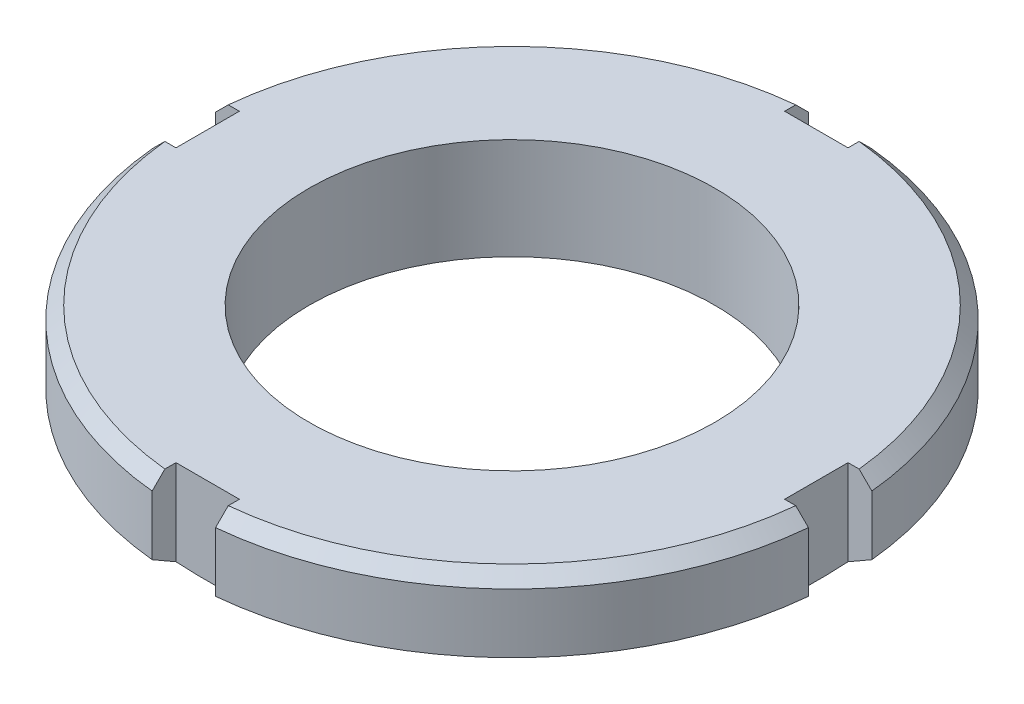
ISO-10303-21;
HEADER;
FILE_DESCRIPTION(('STEP AP214'),'2;1');
FILE_NAME('part.step','',(''),(''),'','','');
FILE_SCHEMA(('AUTOMOTIVE_DESIGN { 1 0 10303 214 1 1 1 1 }'));
ENDSEC;
DATA;
#1=APPLICATION_CONTEXT('core data for automotive mechanical design processes');
#2=APPLICATION_PROTOCOL_DEFINITION('international standard','automotive_design',2000,#1);
#3=PRODUCT_CONTEXT('',#1,'mechanical');
#4=PRODUCT('Part','Part','',(#3));
#5=PRODUCT_RELATED_PRODUCT_CATEGORY('part','',(#4));
#6=PRODUCT_DEFINITION_FORMATION('','',#4);
#7=PRODUCT_DEFINITION_CONTEXT('part definition',#1,'design');
#8=PRODUCT_DEFINITION('design','',#6,#7);
#9=PRODUCT_DEFINITION_SHAPE('','',#8);
#10=(LENGTH_UNIT() NAMED_UNIT(*) SI_UNIT(.MILLI.,.METRE.));
#11=(NAMED_UNIT(*) PLANE_ANGLE_UNIT() SI_UNIT($,.RADIAN.));
#12=(NAMED_UNIT(*) SI_UNIT($,.STERADIAN.) SOLID_ANGLE_UNIT());
#13=UNCERTAINTY_MEASURE_WITH_UNIT(LENGTH_MEASURE(1.E-05),#10,'distance_accuracy_value','');
#14=(GEOMETRIC_REPRESENTATION_CONTEXT(3) GLOBAL_UNCERTAINTY_ASSIGNED_CONTEXT((#13)) GLOBAL_UNIT_ASSIGNED_CONTEXT((#10,
#11,#12)) REPRESENTATION_CONTEXT('',''));
#15=CARTESIAN_POINT('',(0.,0.,0.));
#16=DIRECTION('',(0.,0.,1.));
#17=DIRECTION('',(1.,0.,0.));
#18=AXIS2_PLACEMENT_3D('',#15,#16,#17);
#19=CARTESIAN_POINT('',(0.,38.0188235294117,0.));
#20=DIRECTION('',(0.,1.,0.));
#21=DIRECTION('',(-1.00000000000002,0.,0.));
#22=AXIS2_PLACEMENT_3D('',#19,#20,#21);
#23=CYLINDRICAL_SURFACE('',#22,26.);
#24=CARTESIAN_POINT('',(0.,-1.,0.));
#25=DIRECTION('',(0.,-1.,0.));
#26=DIRECTION('',(1.00000000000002,0.,0.));
#27=AXIS2_PLACEMENT_3D('',#24,#25,#26);
#28=CIRCLE('',#27,26.);
#29=CARTESIAN_POINT('',(-2.50000000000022,-1.,25.8795285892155));
#30=VERTEX_POINT('',#29);
#31=CARTESIAN_POINT('',(-25.8795285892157,-1.,2.49999999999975));
#32=VERTEX_POINT('',#31);
#33=EDGE_CURVE('E367',#30,#32,#28,.T.);
#34=ORIENTED_EDGE('',*,*,#33,.T.);
#35=DIRECTION('',(0.,1.,0.));
#36=VECTOR('',#35,1.);
#37=CARTESIAN_POINT('',(-25.8795285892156,38.0188235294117,2.49999999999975));
#38=LINE('',#37,#36);
#39=CARTESIAN_POINT('',(-25.8795285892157,-5.6905989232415,2.49999999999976));
#40=VERTEX_POINT('',#39);
#41=EDGE_CURVE('E193',#32,#40,#38,.F.);
#42=ORIENTED_EDGE('',*,*,#41,.T.);
#43=CARTESIAN_POINT('',(0.,-5.6905989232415,0.));
#44=DIRECTION('',(0.,1.,0.));
#45=DIRECTION('',(-1.00000000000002,0.,0.));
#46=AXIS2_PLACEMENT_3D('',#43,#44,#45);
#47=CIRCLE('',#46,26.);
#48=CARTESIAN_POINT('',(-2.50000000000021,-5.6905989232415,25.8795285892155));
#49=VERTEX_POINT('',#48);
#50=EDGE_CURVE('E351',#40,#49,#47,.T.);
#51=ORIENTED_EDGE('',*,*,#50,.T.);
#52=DIRECTION('',(0.,1.,0.));
#53=VECTOR('',#52,1.);
#54=CARTESIAN_POINT('',(-2.50000000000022,38.0188235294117,25.8795285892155));
#55=LINE('',#54,#53);
#56=EDGE_CURVE('E379',#49,#30,#55,.T.);
#57=ORIENTED_EDGE('',*,*,#56,.T.);
#58=EDGE_LOOP('',(#34,#42,#51,#57));
#59=FACE_BOUND('',#58,.T.);
#60=ADVANCED_FACE('F16',(#59),#23,.T.);
#61=CARTESIAN_POINT('',(0.,0.,0.));
#62=DIRECTION('',(0.,-1.,0.));
#63=DIRECTION('',(1.00000000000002,0.,0.));
#64=AXIS2_PLACEMENT_3D('',#61,#62,#63);
#65=CONICAL_SURFACE('',#64,25.,0.785398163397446);
#66=CARTESIAN_POINT('',(-28.8361348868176,-3.94430298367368,2.49999999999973));
#67=CARTESIAN_POINT('',(-28.3118080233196,-3.4219371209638,2.49999999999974));
#68=CARTESIAN_POINT('',(-27.7874295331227,-2.8996230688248,2.49999999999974));
#69=CARTESIAN_POINT('',(-26.7385465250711,-1.85512161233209,2.49999999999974));
#70=CARTESIAN_POINT('',(-26.2140420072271,-1.33293420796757,2.49999999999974));
#71=CARTESIAN_POINT('',(-25.1648840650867,-0.288708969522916,2.49999999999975));
#72=CARTESIAN_POINT('',(-24.6402306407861,0.233328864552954,2.49999999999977));
#73=CARTESIAN_POINT('',(-23.5907418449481,1.27722169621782,2.49999999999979));
#74=CARTESIAN_POINT('',(-23.0659064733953,1.79907669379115,2.4999999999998));
#75=CARTESIAN_POINT('',(-22.5409636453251,2.32082360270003,2.4999999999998));
#76=B_SPLINE_CURVE_WITH_KNOTS('',3,(#66,#67,#68,#69,#70,#71,#72,#73,#74,#75),.UNSPECIFIED.,.F.,
.F.,(4,2,2,2,4),(0.,2.22037447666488,4.44074876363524,6.66112311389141,8.88149765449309),.UNSPECIFIED.);
#77=CARTESIAN_POINT('',(-24.8746859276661,0.,2.49999999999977));
#78=VERTEX_POINT('',#77);
#79=EDGE_CURVE('E11',#32,#78,#76,.T.);
#80=ORIENTED_EDGE('',*,*,#79,.F.);
#81=ORIENTED_EDGE('',*,*,#33,.F.);
#82=CARTESIAN_POINT('',(-2.50000000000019,3.0690672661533,21.7879739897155));
#83=CARTESIAN_POINT('',(-2.50000000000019,2.54743215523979,22.3130279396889));
#84=CARTESIAN_POINT('',(-2.50000000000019,2.02567763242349,22.8379632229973));
#85=CARTESIAN_POINT('',(-2.5000000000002,0.981967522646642,23.8876337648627));
#86=CARTESIAN_POINT('',(-2.5000000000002,0.460011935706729,24.4123690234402));
#87=CARTESIAN_POINT('',(-2.50000000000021,-0.584062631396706,25.4616769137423));
#88=CARTESIAN_POINT('',(-2.50000000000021,-1.10618161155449,25.9862495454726));
#89=CARTESIAN_POINT('',(-2.50000000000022,-2.15055730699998,27.0352577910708));
#90=CARTESIAN_POINT('',(-2.50000000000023,-2.67281402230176,27.5596934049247));
#91=CARTESIAN_POINT('',(-2.50000000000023,-3.19512671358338,28.0840732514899));
#92=B_SPLINE_CURVE_WITH_KNOTS('',3,(#82,#83,#84,#85,#86,#87,#88,#89,#90,#91),.UNSPECIFIED.,.F.,
.F.,(4,2,2,2,4),(0.,2.22037459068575,4.44074895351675,6.66112323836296,8.88149775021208),.UNSPECIFIED.);
#93=CARTESIAN_POINT('',(-2.50000000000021,0.,24.874685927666));
#94=VERTEX_POINT('',#93);
#95=EDGE_CURVE('E215',#94,#30,#92,.T.);
#96=ORIENTED_EDGE('',*,*,#95,.F.);
#97=CARTESIAN_POINT('',(0.,0.,0.));
#98=DIRECTION('',(0.,-1.,0.));
#99=DIRECTION('',(1.00000000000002,0.,0.));
#100=AXIS2_PLACEMENT_3D('',#97,#98,#99);
#101=CIRCLE('',#100,25.);
#102=EDGE_CURVE('E44',#78,#94,#101,.F.);
#103=ORIENTED_EDGE('',*,*,#102,.F.);
#104=EDGE_LOOP('',(#80,#81,#96,#103));
#105=FACE_BOUND('',#104,.T.);
#106=ADVANCED_FACE('F382',(#105),#65,.T.);
#107=CARTESIAN_POINT('',(25.8795285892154,-1.,2.50000000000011));
#108=VERTEX_POINT('',#107);
#109=CARTESIAN_POINT('',(2.49999999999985,-1.,25.8795285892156));
#110=VERTEX_POINT('',#109);
#111=EDGE_CURVE('E362',#108,#110,#28,.T.);
#112=ORIENTED_EDGE('',*,*,#111,.T.);
#113=DIRECTION('',(0.,1.,0.));
#114=VECTOR('',#113,1.);
#115=CARTESIAN_POINT('',(2.49999999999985,38.0188235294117,25.8795285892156));
#116=LINE('',#115,#114);
#117=CARTESIAN_POINT('',(2.49999999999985,-5.6905989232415,25.8795285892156));
#118=VERTEX_POINT('',#117);
#119=EDGE_CURVE('E243',#110,#118,#116,.F.);
#120=ORIENTED_EDGE('',*,*,#119,.T.);
#121=CARTESIAN_POINT('',(25.8795285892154,-5.6905989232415,2.50000000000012));
#122=VERTEX_POINT('',#121);
#123=EDGE_CURVE('E414',#118,#122,#47,.T.);
#124=ORIENTED_EDGE('',*,*,#123,.T.);
#125=DIRECTION('',(0.,1.,0.));
#126=VECTOR('',#125,1.);
#127=CARTESIAN_POINT('',(25.8795285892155,38.0188235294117,2.50000000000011));
#128=LINE('',#127,#126);
#129=EDGE_CURVE('E262',#122,#108,#128,.T.);
#130=ORIENTED_EDGE('',*,*,#129,.T.);
#131=EDGE_LOOP('',(#112,#120,#124,#130));
#132=FACE_BOUND('',#131,.T.);
#133=ADVANCED_FACE('F462',(#132),#23,.T.);
#134=CARTESIAN_POINT('',(2.49999999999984,-3.19512671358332,28.0840732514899));
#135=CARTESIAN_POINT('',(2.49999999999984,-2.67281402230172,27.5596934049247));
#136=CARTESIAN_POINT('',(2.49999999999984,-2.15055730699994,27.0352577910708));
#137=CARTESIAN_POINT('',(2.49999999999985,-1.10618161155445,25.9862495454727));
#138=CARTESIAN_POINT('',(2.49999999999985,-0.584062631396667,25.4616769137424));
#139=CARTESIAN_POINT('',(2.49999999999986,0.460011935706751,24.4123690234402));
#140=CARTESIAN_POINT('',(2.49999999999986,0.981967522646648,23.8876337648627));
#141=CARTESIAN_POINT('',(2.49999999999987,2.02567763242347,22.8379632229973));
#142=CARTESIAN_POINT('',(2.49999999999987,2.54743215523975,22.313027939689));
#143=CARTESIAN_POINT('',(2.49999999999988,3.06906726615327,21.7879739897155));
#144=B_SPLINE_CURVE_WITH_KNOTS('',3,(#134,#135,#136,#137,#138,#139,#140,#141,#142,#143),
.UNSPECIFIED.,.F.,.F.,(4,2,2,2,4),(0.,2.22037451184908,4.44074879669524,6.66112315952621,
8.88149775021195),.UNSPECIFIED.);
#145=CARTESIAN_POINT('',(2.49999999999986,0.,24.874685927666));
#146=VERTEX_POINT('',#145);
#147=EDGE_CURVE('E209',#110,#146,#144,.T.);
#148=ORIENTED_EDGE('',*,*,#147,.F.);
#149=ORIENTED_EDGE('',*,*,#111,.F.);
#150=CARTESIAN_POINT('',(21.7879739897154,3.0690672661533,2.50000000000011));
#151=CARTESIAN_POINT('',(22.3130279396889,2.54743215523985,2.50000000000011));
#152=CARTESIAN_POINT('',(22.8379632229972,2.02567763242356,2.50000000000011));
#153=CARTESIAN_POINT('',(23.8876337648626,0.981967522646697,2.50000000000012));
#154=CARTESIAN_POINT('',(24.4123690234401,0.460011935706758,2.50000000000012));
#155=CARTESIAN_POINT('',(25.4616769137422,-0.584062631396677,2.50000000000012));
#156=CARTESIAN_POINT('',(25.9862495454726,-1.10618161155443,2.50000000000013));
#157=CARTESIAN_POINT('',(27.0352577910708,-2.1505573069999,2.50000000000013));
#158=CARTESIAN_POINT('',(27.5596934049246,-2.67281402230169,2.50000000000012));
#159=CARTESIAN_POINT('',(28.0840732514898,-3.19512671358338,2.50000000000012));
#160=B_SPLINE_CURVE_WITH_KNOTS('',3,(#150,#151,#152,#153,#154,#155,#156,#157,#158,#159),
.UNSPECIFIED.,.F.,.F.,(4,2,2,2,4),(0.,2.22037459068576,4.44074895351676,6.66112323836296,
8.88149775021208),.UNSPECIFIED.);
#161=CARTESIAN_POINT('',(24.8746859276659,0.,2.50000000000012));
#162=VERTEX_POINT('',#161);
#163=EDGE_CURVE('E303',#162,#108,#160,.T.);
#164=ORIENTED_EDGE('',*,*,#163,.F.);
#165=EDGE_CURVE('E383',#146,#162,#101,.F.);
#166=ORIENTED_EDGE('',*,*,#165,.F.);
#167=EDGE_LOOP('',(#148,#149,#164,#166));
#168=FACE_BOUND('',#167,.T.);
#169=ADVANCED_FACE('F459',(#168),#65,.T.);
#170=CARTESIAN_POINT('',(2.50000000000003,-1.,-25.8795285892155));
#171=VERTEX_POINT('',#170);
#172=CARTESIAN_POINT('',(25.8795285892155,-1.,-2.49999999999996));
#173=VERTEX_POINT('',#172);
#174=EDGE_CURVE('E360',#171,#173,#28,.T.);
#175=ORIENTED_EDGE('',*,*,#174,.T.);
#176=DIRECTION('',(0.,1.,0.));
#177=VECTOR('',#176,1.);
#178=CARTESIAN_POINT('',(25.8795285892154,38.0188235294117,-2.49999999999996));
#179=LINE('',#178,#177);
#180=CARTESIAN_POINT('',(25.8795285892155,-5.6905989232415,-2.49999999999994));
#181=VERTEX_POINT('',#180);
#182=EDGE_CURVE('E272',#173,#181,#179,.F.);
#183=ORIENTED_EDGE('',*,*,#182,.T.);
#184=CARTESIAN_POINT('',(2.50000000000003,-5.6905989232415,-25.8795285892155));
#185=VERTEX_POINT('',#184);
#186=EDGE_CURVE('E346',#181,#185,#47,.T.);
#187=ORIENTED_EDGE('',*,*,#186,.T.);
#188=DIRECTION('',(0.,1.,0.));
#189=VECTOR('',#188,1.);
#190=CARTESIAN_POINT('',(2.50000000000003,38.0188235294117,-25.8795285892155));
#191=LINE('',#190,#189);
#192=EDGE_CURVE('E472',#185,#171,#191,.T.);
#193=ORIENTED_EDGE('',*,*,#192,.T.);
#194=EDGE_LOOP('',(#175,#183,#187,#193));
#195=FACE_BOUND('',#194,.T.);
#196=ADVANCED_FACE('F408',(#195),#23,.T.);
#197=CARTESIAN_POINT('',(28.0840732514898,-3.19512671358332,-2.49999999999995));
#198=CARTESIAN_POINT('',(27.5596934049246,-2.67281402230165,-2.49999999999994));
#199=CARTESIAN_POINT('',(27.0352577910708,-2.15055730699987,-2.49999999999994));
#200=CARTESIAN_POINT('',(25.9862495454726,-1.10618161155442,-2.49999999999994));
#201=CARTESIAN_POINT('',(25.4616769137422,-0.584062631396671,-2.49999999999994));
#202=CARTESIAN_POINT('',(24.4123690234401,0.460011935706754,-2.49999999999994));
#203=CARTESIAN_POINT('',(23.8876337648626,0.981967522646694,-2.49999999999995));
#204=CARTESIAN_POINT('',(22.8379632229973,2.02567763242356,-2.49999999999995));
#205=CARTESIAN_POINT('',(22.3130279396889,2.54743215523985,-2.49999999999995));
#206=CARTESIAN_POINT('',(21.7879739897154,3.0690672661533,-2.49999999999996));
#207=B_SPLINE_CURVE_WITH_KNOTS('',3,(#197,#198,#199,#200,#201,#202,#203,#204,#205,#206),
.UNSPECIFIED.,.F.,.F.,(4,2,2,2,4),(0.,2.22037451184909,4.44074879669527,6.66112315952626,
8.881497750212),.UNSPECIFIED.);
#208=CARTESIAN_POINT('',(24.8746859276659,0.,-2.49999999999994));
#209=VERTEX_POINT('',#208);
#210=EDGE_CURVE('E298',#173,#209,#207,.T.);
#211=ORIENTED_EDGE('',*,*,#210,.F.);
#212=ORIENTED_EDGE('',*,*,#174,.F.);
#213=CARTESIAN_POINT('',(2.50000000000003,2.32082360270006,-22.5409636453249));
#214=CARTESIAN_POINT('',(2.50000000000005,1.79907669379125,-23.0659064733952));
#215=CARTESIAN_POINT('',(2.50000000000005,1.27722169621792,-23.5907418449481));
#216=CARTESIAN_POINT('',(2.50000000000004,0.233328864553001,-24.6402306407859));
#217=CARTESIAN_POINT('',(2.50000000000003,-0.288708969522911,-25.1648840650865));
#218=CARTESIAN_POINT('',(2.50000000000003,-1.33293420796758,-26.214042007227));
#219=CARTESIAN_POINT('',(2.50000000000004,-1.85512161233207,-26.738546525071));
#220=CARTESIAN_POINT('',(2.50000000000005,-2.89962306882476,-27.7874295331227));
#221=CARTESIAN_POINT('',(2.50000000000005,-3.42193712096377,-28.3118080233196));
#222=CARTESIAN_POINT('',(2.50000000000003,-3.94430298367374,-28.8361348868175));
#223=B_SPLINE_CURVE_WITH_KNOTS('',3,(#213,#214,#215,#216,#217,#218,#219,#220,#221,#222),
.UNSPECIFIED.,.F.,.F.,(4,2,2,2,4),(0.,2.22037454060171,4.44074889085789,6.6611231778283,
8.88149765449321),.UNSPECIFIED.);
#224=CARTESIAN_POINT('',(2.50000000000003,0.,-24.874685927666));
#225=VERTEX_POINT('',#224);
#226=EDGE_CURVE('E314',#225,#171,#223,.T.);
#227=ORIENTED_EDGE('',*,*,#226,.F.);
#228=EDGE_CURVE('E357',#209,#225,#101,.F.);
#229=ORIENTED_EDGE('',*,*,#228,.F.);
#230=EDGE_LOOP('',(#211,#212,#227,#229));
#231=FACE_BOUND('',#230,.T.);
#232=ADVANCED_FACE('F405',(#231),#65,.T.);
#233=CARTESIAN_POINT('',(0.,38.0188235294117,0.));
#234=DIRECTION('',(0.,1.,0.));
#235=DIRECTION('',(-1.00000000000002,0.,0.));
#236=AXIS2_PLACEMENT_3D('',#233,#234,#235);
#237=CYLINDRICAL_SURFACE('',#236,16.);
#238=CARTESIAN_POINT('',(0.,-8.00000000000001,0.));
#239=DIRECTION('',(0.,1.,0.));
#240=DIRECTION('',(-1.00000000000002,0.,0.));
#241=AXIS2_PLACEMENT_3D('',#238,#239,#240);
#242=CIRCLE('',#241,16.);
#243=CARTESIAN_POINT('',(-16.0000000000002,-8.00000000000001,0.));
#244=VERTEX_POINT('',#243);
#245=EDGE_CURVE('E354',#244,#244,#242,.T.);
#246=ORIENTED_EDGE('',*,*,#245,.F.);
#247=EDGE_LOOP('',(#246));
#248=FACE_BOUND('',#247,.T.);
#249=CARTESIAN_POINT('',(0.,0.,0.));
#250=DIRECTION('',(0.,1.,0.));
#251=DIRECTION('',(-1.00000000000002,0.,0.));
#252=AXIS2_PLACEMENT_3D('',#249,#250,#251);
#253=CIRCLE('',#252,16.);
#254=CARTESIAN_POINT('',(-16.0000000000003,0.,0.));
#255=VERTEX_POINT('',#254);
#256=EDGE_CURVE('E343',#255,#255,#253,.T.);
#257=ORIENTED_EDGE('',*,*,#256,.T.);
#258=EDGE_LOOP('',(#257));
#259=FACE_BOUND('',#258,.T.);
#260=ADVANCED_FACE('F504',(#248,#259),#237,.F.);
#261=CARTESIAN_POINT('',(16.0000000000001,-8.00000000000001,0.));
#262=DIRECTION('',(0.,1.,0.));
#263=DIRECTION('',(-1.00000000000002,0.,0.));
#264=AXIS2_PLACEMENT_3D('',#261,#262,#263);
#265=PLANE('',#264);
#266=CARTESIAN_POINT('',(0.,-8.00000000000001,0.));
#267=DIRECTION('',(0.,1.,0.));
#268=DIRECTION('',(-1.00000000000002,0.,0.));
#269=AXIS2_PLACEMENT_3D('',#266,#267,#268);
#270=CIRCLE('',#269,22.);
#271=CARTESIAN_POINT('',(-22.0000000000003,-8.00000000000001,0.));
#272=VERTEX_POINT('',#271);
#273=EDGE_CURVE('E350',#272,#272,#270,.T.);
#274=ORIENTED_EDGE('',*,*,#273,.F.);
#275=EDGE_LOOP('',(#274));
#276=FACE_BOUND('',#275,.T.);
#277=ORIENTED_EDGE('',*,*,#245,.T.);
#278=EDGE_LOOP('',(#277));
#279=FACE_BOUND('',#278,.T.);
#280=ADVANCED_FACE('F498',(#276,#279),#265,.F.);
#281=CARTESIAN_POINT('',(0.,-8.00000000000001,0.));
#282=DIRECTION('',(0.,1.,0.));
#283=DIRECTION('',(-1.00000000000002,0.,0.));
#284=AXIS2_PLACEMENT_3D('',#281,#282,#283);
#285=CONICAL_SURFACE('',#284,22.,1.0471975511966);
#286=ORIENTED_EDGE('',*,*,#50,.F.);
#287=CARTESIAN_POINT('',(-30.5676890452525,-2.99451704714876,2.4999999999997));
#288=CARTESIAN_POINT('',(-29.7494430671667,-3.46535532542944,2.49999999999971));
#289=CARTESIAN_POINT('',(-28.931146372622,-3.9361055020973,2.49999999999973));
#290=CARTESIAN_POINT('',(-27.2944127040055,-4.87736160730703,2.49999999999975));
#291=CARTESIAN_POINT('',(-26.4759757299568,-5.34786753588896,2.49999999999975));
#292=CARTESIAN_POINT('',(-24.8389223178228,-6.2885672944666,2.49999999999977));
#293=CARTESIAN_POINT('',(-24.0203058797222,-6.75876112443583,2.49999999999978));
#294=CARTESIAN_POINT('',(-22.3828235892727,-7.69871457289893,2.49999999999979));
#295=CARTESIAN_POINT('',(-21.5639577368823,-8.16847419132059,2.4999999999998));
#296=CARTESIAN_POINT('',(-20.7449323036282,-8.63795558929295,2.4999999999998));
#297=B_SPLINE_CURVE_WITH_KNOTS('',3,(#287,#288,#289,#290,#291,#292,#293,#294,#295,#296),
.UNSPECIFIED.,.F.,.F.,(4,2,2,2,4),(0.,2.83212580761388,5.66425115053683,8.49637673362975,
11.3285027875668),.UNSPECIFIED.);
#298=CARTESIAN_POINT('',(-24.0000000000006,-6.7703264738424,2.49999999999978));
#299=VERTEX_POINT('',#298);
#300=EDGE_CURVE('E435',#40,#299,#297,.T.);
#301=ORIENTED_EDGE('',*,*,#300,.T.);
#302=CARTESIAN_POINT('',(-24.0000000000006,-5.87325116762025,9.14599427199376));
#303=CARTESIAN_POINT('',(-24.0000000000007,-5.9671759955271,8.68920886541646));
#304=CARTESIAN_POINT('',(-24.0000000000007,-6.05519023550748,8.23118272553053));
#305=CARTESIAN_POINT('',(-24.0000000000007,-6.21853495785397,7.3128171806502));
#306=CARTESIAN_POINT('',(-24.0000000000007,-6.29386380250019,6.85247748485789));
#307=CARTESIAN_POINT('',(-24.0000000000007,-6.43099412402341,5.92947716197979));
#308=CARTESIAN_POINT('',(-24.0000000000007,-6.49278695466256,5.46681524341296));
#309=CARTESIAN_POINT('',(-24.0000000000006,-6.6020125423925,4.53981251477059));
#310=CARTESIAN_POINT('',(-24.0000000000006,-6.64944589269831,4.07547177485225));
#311=CARTESIAN_POINT('',(-24.0000000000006,-6.72871584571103,3.15252788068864));
#312=CARTESIAN_POINT('',(-24.0000000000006,-6.76077740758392,2.6939441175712));
#313=CARTESIAN_POINT('',(-24.0000000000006,-6.80991883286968,1.77597463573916));
#314=CARTESIAN_POINT('',(-24.0000000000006,-6.82699881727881,1.31658892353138));
#315=CARTESIAN_POINT('',(-24.0000000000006,-6.84593211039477,0.397679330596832));
#316=CARTESIAN_POINT('',(-24.0000000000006,-6.8477912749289,-0.0618444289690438));
#317=CARTESIAN_POINT('',(-24.0000000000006,-6.83627175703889,-0.980698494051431));
#318=CARTESIAN_POINT('',(-24.0000000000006,-6.82289312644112,-1.44002880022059));
#319=CARTESIAN_POINT('',(-24.0000000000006,-6.78112901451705,-2.35710227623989));
#320=CARTESIAN_POINT('',(-24.0000000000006,-6.75277297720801,-2.8148467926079));
#321=CARTESIAN_POINT('',(-24.0000000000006,-6.68146073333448,-3.72921742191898));
#322=CARTESIAN_POINT('',(-24.0000000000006,-6.63850370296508,-4.18584347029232));
#323=CARTESIAN_POINT('',(-24.0000000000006,-6.53853142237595,-5.09774571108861));
#324=CARTESIAN_POINT('',(-24.0000000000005,-6.48151026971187,-5.55302125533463));
#325=CARTESIAN_POINT('',(-24.0000000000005,-6.35412474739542,-6.46170381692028));
#326=CARTESIAN_POINT('',(-24.0000000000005,-6.28375973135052,-6.91511074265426));
#327=CARTESIAN_POINT('',(-24.0000000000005,-6.05145240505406,-8.28617090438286));
#328=CARTESIAN_POINT('',(-24.0000000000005,-5.86988260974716,-9.2005659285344));
#329=CARTESIAN_POINT('',(-24.0000000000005,-5.56431086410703,-10.5639819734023));
#330=CARTESIAN_POINT('',(-24.0000000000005,-5.45697916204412,-11.0168676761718));
#331=CARTESIAN_POINT('',(-24.0000000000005,-5.23215225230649,-11.920025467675));
#332=CARTESIAN_POINT('',(-24.0000000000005,-5.11465889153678,-12.3702980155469));
#333=CARTESIAN_POINT('',(-24.0000000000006,-4.99252526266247,-12.8193241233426));
#334=B_SPLINE_CURVE_WITH_KNOTS('',3,(#302,#303,#304,#305,#306,#307,#308,#309,#310,#311,#312,
#313,#314,#315,#316,#317,#318,#319,#320,#321,#322,#323,#324,#325,#326,#327,#328,#329,#330,#331,
#332,#333),.UNSPECIFIED.,.F.,.F.,(4,2,2,2,2,2,2,2,2,2,2,2,2,2,2,4),(0.,1.39902366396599,
2.79822780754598,4.19832311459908,5.59836057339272,6.9772314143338,8.35609111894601,
9.73442031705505,11.1127448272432,12.4883697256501,13.864072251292,15.2403531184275,
16.6167006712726,19.4118937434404,20.8080999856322,22.204052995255),.UNSPECIFIED.);
#335=CARTESIAN_POINT('',(-24.0000000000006,-6.7703264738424,-2.50000000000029));
#336=VERTEX_POINT('',#335);
#337=EDGE_CURVE('E166',#299,#336,#334,.T.);
#338=ORIENTED_EDGE('',*,*,#337,.T.);
#339=CARTESIAN_POINT('',(-20.7449323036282,-8.63795558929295,-2.50000000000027));
#340=CARTESIAN_POINT('',(-21.5639577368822,-8.16847419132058,-2.50000000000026));
#341=CARTESIAN_POINT('',(-22.3828235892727,-7.69871457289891,-2.50000000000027));
#342=CARTESIAN_POINT('',(-24.0203058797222,-6.75876112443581,-2.50000000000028));
#343=CARTESIAN_POINT('',(-24.8389223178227,-6.28856729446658,-2.50000000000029));
#344=CARTESIAN_POINT('',(-26.4759757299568,-5.34786753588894,-2.50000000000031));
#345=CARTESIAN_POINT('',(-27.2944127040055,-4.877361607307,-2.50000000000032));
#346=CARTESIAN_POINT('',(-28.931146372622,-3.93610550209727,-2.50000000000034));
#347=CARTESIAN_POINT('',(-29.7494430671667,-3.46535532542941,-2.50000000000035));
#348=CARTESIAN_POINT('',(-30.5676890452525,-2.99451704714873,-2.50000000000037));
#349=B_SPLINE_CURVE_WITH_KNOTS('',3,(#339,#340,#341,#342,#343,#344,#345,#346,#347,#348),
.UNSPECIFIED.,.F.,.F.,(4,2,2,2,4),(0.,2.83212605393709,5.66425163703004,8.49637697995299,
11.3285027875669),.UNSPECIFIED.);
#350=CARTESIAN_POINT('',(-25.8795285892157,-5.6905989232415,-2.50000000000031));
#351=VERTEX_POINT('',#350);
#352=EDGE_CURVE('E185',#336,#351,#349,.T.);
#353=ORIENTED_EDGE('',*,*,#352,.T.);
#354=CARTESIAN_POINT('',(-2.50000000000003,-5.6905989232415,-25.8795285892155));
#355=VERTEX_POINT('',#354);
#356=EDGE_CURVE('E347',#355,#351,#47,.T.);
#357=ORIENTED_EDGE('',*,*,#356,.F.);
#358=CARTESIAN_POINT('',(-2.50000000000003,-2.99451704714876,-30.5676890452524));
#359=CARTESIAN_POINT('',(-2.50000000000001,-3.4653553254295,-29.7494430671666));
#360=CARTESIAN_POINT('',(-2.50000000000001,-3.93610550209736,-28.9311463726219));
#361=CARTESIAN_POINT('',(-2.50000000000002,-4.87736160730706,-27.2944127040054));
#362=CARTESIAN_POINT('',(-2.50000000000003,-5.34786753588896,-26.4759757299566));
#363=CARTESIAN_POINT('',(-2.50000000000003,-6.2885672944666,-24.8389223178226));
#364=CARTESIAN_POINT('',(-2.50000000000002,-6.75876112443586,-24.0203058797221));
#365=CARTESIAN_POINT('',(-2.50000000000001,-7.69871457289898,-22.3828235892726));
#366=CARTESIAN_POINT('',(-2.5,-8.16847419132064,-21.5639577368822));
#367=CARTESIAN_POINT('',(-2.50000000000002,-8.63795558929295,-20.7449323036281));
#368=B_SPLINE_CURVE_WITH_KNOTS('',3,(#358,#359,#360,#361,#362,#363,#364,#365,#366,#367),
.UNSPECIFIED.,.F.,.F.,(4,2,2,2,4),(0.,2.83212580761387,5.66425115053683,8.49637673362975,
11.3285027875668),.UNSPECIFIED.);
#369=CARTESIAN_POINT('',(-2.50000000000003,-6.7703264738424,-24.0000000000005));
#370=VERTEX_POINT('',#369);
#371=EDGE_CURVE('E328',#355,#370,#368,.T.);
#372=ORIENTED_EDGE('',*,*,#371,.T.);
#373=CARTESIAN_POINT('',(-12.8193241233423,-4.99252526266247,-24.0000000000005));
#374=CARTESIAN_POINT('',(-12.3702980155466,-5.11465889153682,-24.0000000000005));
#375=CARTESIAN_POINT('',(-11.9200254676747,-5.23215225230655,-24.0000000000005));
#376=CARTESIAN_POINT('',(-11.0168676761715,-5.4569791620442,-24.0000000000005));
#377=CARTESIAN_POINT('',(-10.563981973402,-5.5643108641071,-24.0000000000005));
#378=CARTESIAN_POINT('',(-9.20056592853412,-5.86988260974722,-24.0000000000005));
#379=CARTESIAN_POINT('',(-8.28617090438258,-6.05145240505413,-24.0000000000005));
#380=CARTESIAN_POINT('',(-6.91511074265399,-6.28375973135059,-24.0000000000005));
#381=CARTESIAN_POINT('',(-6.46170381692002,-6.35412474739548,-24.0000000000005));
#382=CARTESIAN_POINT('',(-5.55302125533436,-6.48151026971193,-24.0000000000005));
#383=CARTESIAN_POINT('',(-5.09774571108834,-6.538531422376,-24.0000000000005));
#384=CARTESIAN_POINT('',(-4.18584347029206,-6.63850370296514,-24.0000000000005));
#385=CARTESIAN_POINT('',(-3.72921742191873,-6.68146073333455,-24.0000000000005));
#386=CARTESIAN_POINT('',(-2.81484679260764,-6.75277297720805,-24.0000000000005));
#387=CARTESIAN_POINT('',(-2.35710227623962,-6.78112901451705,-24.0000000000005));
#388=CARTESIAN_POINT('',(-1.44002880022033,-6.82289312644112,-24.0000000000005));
#389=CARTESIAN_POINT('',(-0.980698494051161,-6.83627175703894,-24.0000000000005));
#390=CARTESIAN_POINT('',(-0.0618444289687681,-6.84779127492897,-24.0000000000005));
#391=CARTESIAN_POINT('',(0.397679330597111,-6.84593211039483,-24.0000000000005));
#392=CARTESIAN_POINT('',(1.31658892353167,-6.82699881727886,-24.0000000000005));
#393=CARTESIAN_POINT('',(1.77597463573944,-6.80991883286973,-24.0000000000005));
#394=CARTESIAN_POINT('',(2.6939441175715,-6.76077740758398,-24.0000000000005));
#395=CARTESIAN_POINT('',(3.15252788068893,-6.72871584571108,-24.0000000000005));
#396=CARTESIAN_POINT('',(4.07547177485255,-6.64944589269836,-24.0000000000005));
#397=CARTESIAN_POINT('',(4.5398125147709,-6.60201254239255,-24.0000000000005));
#398=CARTESIAN_POINT('',(5.46681524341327,-6.49278695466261,-24.0000000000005));
#399=CARTESIAN_POINT('',(5.9294771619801,-6.43099412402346,-24.0000000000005));
#400=CARTESIAN_POINT('',(6.8524774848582,-6.29386380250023,-24.0000000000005));
#401=CARTESIAN_POINT('',(7.31281718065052,-6.21853495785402,-24.0000000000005));
#402=CARTESIAN_POINT('',(8.23118272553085,-6.05519023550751,-24.0000000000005));
#403=CARTESIAN_POINT('',(8.68920886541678,-5.96717599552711,-24.0000000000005));
#404=CARTESIAN_POINT('',(9.14599427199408,-5.87325116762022,-24.0000000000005));
#405=B_SPLINE_CURVE_WITH_KNOTS('',3,(#373,#374,#375,#376,#377,#378,#379,#380,#381,#382,#383,
#384,#385,#386,#387,#388,#389,#390,#391,#392,#393,#394,#395,#396,#397,#398,#399,#400,#401,#402,
#403,#404),.UNSPECIFIED.,.F.,.F.,(4,2,2,2,2,2,2,2,2,2,2,2,2,2,2,4),(0.,1.39595300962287,
2.79215925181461,5.5873523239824,6.96369987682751,8.33998074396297,9.71568326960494,
11.0913081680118,12.4696326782,13.847961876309,15.2268215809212,16.6056924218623,
18.005729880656,19.4058251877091,20.8050293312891,22.2040529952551),.UNSPECIFIED.);
#406=CARTESIAN_POINT('',(2.50000000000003,-6.7703264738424,-24.0000000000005));
#407=VERTEX_POINT('',#406);
#408=EDGE_CURVE('E335',#370,#407,#405,.T.);
#409=ORIENTED_EDGE('',*,*,#408,.T.);
#410=CARTESIAN_POINT('',(2.50000000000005,-8.63795558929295,-20.7449323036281));
#411=CARTESIAN_POINT('',(2.50000000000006,-8.16847419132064,-21.5639577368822));
#412=CARTESIAN_POINT('',(2.50000000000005,-7.69871457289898,-22.3828235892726));
#413=CARTESIAN_POINT('',(2.50000000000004,-6.75876112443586,-24.0203058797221));
#414=CARTESIAN_POINT('',(2.50000000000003,-6.2885672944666,-24.8389223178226));
#415=CARTESIAN_POINT('',(2.50000000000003,-5.34786753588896,-26.4759757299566));
#416=CARTESIAN_POINT('',(2.50000000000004,-4.87736160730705,-27.2944127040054));
#417=CARTESIAN_POINT('',(2.50000000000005,-3.93610550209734,-28.9311463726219));
#418=CARTESIAN_POINT('',(2.50000000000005,-3.46535532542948,-29.7494430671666));
#419=CARTESIAN_POINT('',(2.50000000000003,-2.99451704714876,-30.5676890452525));
#420=B_SPLINE_CURVE_WITH_KNOTS('',3,(#410,#411,#412,#413,#414,#415,#416,#417,#418,#419),
.UNSPECIFIED.,.F.,.F.,(4,2,2,2,4),(0.,2.83212605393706,5.66425163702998,8.49637697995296,
11.3285027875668),.UNSPECIFIED.);
#421=EDGE_CURVE('E413',#407,#185,#420,.T.);
#422=ORIENTED_EDGE('',*,*,#421,.T.);
#423=ORIENTED_EDGE('',*,*,#186,.F.);
#424=CARTESIAN_POINT('',(29.1910417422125,-3.78655573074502,-2.49999999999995));
#425=CARTESIAN_POINT('',(28.3727299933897,-4.25727979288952,-2.49999999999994));
#426=CARTESIAN_POINT('',(27.5543604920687,-4.72790350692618,-2.49999999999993));
#427=CARTESIAN_POINT('',(25.9174585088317,-5.66886696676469,-2.49999999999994));
#428=CARTESIAN_POINT('',(25.0989260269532,-6.13920671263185,-2.49999999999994));
#429=CARTESIAN_POINT('',(23.46165012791,-7.07951923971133,-2.49999999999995));
#430=CARTESIAN_POINT('',(22.642906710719,-7.54949202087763,-2.49999999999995));
#431=CARTESIAN_POINT('',(21.0051204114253,-8.48891590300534,-2.49999999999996));
#432=CARTESIAN_POINT('',(20.1860775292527,-8.95836700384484,-2.49999999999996));
#433=CARTESIAN_POINT('',(19.3668407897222,-9.42747982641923,-2.49999999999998));
#434=B_SPLINE_CURVE_WITH_KNOTS('',3,(#424,#425,#426,#427,#428,#429,#430,#431,#432,#433),
.UNSPECIFIED.,.F.,.F.,(4,2,2,2,4),(0.,2.83212596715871,5.66425128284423,8.49637695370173,
11.3285032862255),.UNSPECIFIED.);
#435=CARTESIAN_POINT('',(24.0000000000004,-6.77032647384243,-2.49999999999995));
#436=VERTEX_POINT('',#435);
#437=EDGE_CURVE('E275',#181,#436,#434,.T.);
#438=ORIENTED_EDGE('',*,*,#437,.T.);
#439=CARTESIAN_POINT('',(24.0000000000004,-4.99252526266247,-12.8193241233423));
#440=CARTESIAN_POINT('',(24.0000000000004,-5.11465889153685,-12.3702980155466));
#441=CARTESIAN_POINT('',(24.0000000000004,-5.2321522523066,-11.9200254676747));
#442=CARTESIAN_POINT('',(24.0000000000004,-5.45697916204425,-11.0168676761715));
#443=CARTESIAN_POINT('',(24.0000000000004,-5.56431086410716,-10.563981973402));
#444=CARTESIAN_POINT('',(24.0000000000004,-5.86988260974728,-9.20056592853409));
#445=CARTESIAN_POINT('',(24.0000000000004,-6.05145240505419,-8.28617090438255));
#446=CARTESIAN_POINT('',(24.0000000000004,-6.28375973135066,-6.91511074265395));
#447=CARTESIAN_POINT('',(24.0000000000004,-6.35412474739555,-6.46170381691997));
#448=CARTESIAN_POINT('',(24.0000000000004,-6.48151026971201,-5.55302125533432));
#449=CARTESIAN_POINT('',(24.0000000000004,-6.53853142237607,-5.09774571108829));
#450=CARTESIAN_POINT('',(24.0000000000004,-6.63850370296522,-4.18584347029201));
#451=CARTESIAN_POINT('',(24.0000000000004,-6.68146073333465,-3.72921742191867));
#452=CARTESIAN_POINT('',(24.0000000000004,-6.75277297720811,-2.81484679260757));
#453=CARTESIAN_POINT('',(24.0000000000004,-6.78112901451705,-2.35710227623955));
#454=CARTESIAN_POINT('',(24.0000000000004,-6.82289312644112,-1.44002880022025));
#455=CARTESIAN_POINT('',(24.0000000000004,-6.83627175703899,-0.980698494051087));
#456=CARTESIAN_POINT('',(24.0000000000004,-6.84779127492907,-0.0618444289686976));
#457=CARTESIAN_POINT('',(24.0000000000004,-6.84593211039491,0.397679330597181));
#458=CARTESIAN_POINT('',(24.0000000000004,-6.82699881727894,1.31658892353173));
#459=CARTESIAN_POINT('',(24.0000000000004,-6.80991883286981,1.77597463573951));
#460=CARTESIAN_POINT('',(24.0000000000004,-6.76077740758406,2.69394411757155));
#461=CARTESIAN_POINT('',(24.0000000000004,-6.72871584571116,3.15252788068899));
#462=CARTESIAN_POINT('',(24.0000000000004,-6.64944589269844,4.07547177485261));
#463=CARTESIAN_POINT('',(24.0000000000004,-6.60201254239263,4.53981251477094));
#464=CARTESIAN_POINT('',(24.0000000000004,-6.49278695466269,5.46681524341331));
#465=CARTESIAN_POINT('',(24.0000000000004,-6.43099412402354,5.92947716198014));
#466=CARTESIAN_POINT('',(24.0000000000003,-6.29386380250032,6.85247748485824));
#467=CARTESIAN_POINT('',(24.0000000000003,-6.21853495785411,7.31281718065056));
#468=CARTESIAN_POINT('',(24.0000000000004,-6.05519023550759,8.23118272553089));
#469=CARTESIAN_POINT('',(24.0000000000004,-5.96717599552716,8.68920886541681));
#470=CARTESIAN_POINT('',(24.0000000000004,-5.87325116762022,9.14599427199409));
#471=B_SPLINE_CURVE_WITH_KNOTS('',3,(#439,#440,#441,#442,#443,#444,#445,#446,#447,#448,#449,
#450,#451,#452,#453,#454,#455,#456,#457,#458,#459,#460,#461,#462,#463,#464,#465,#466,#467,#468,
#469,#470),.UNSPECIFIED.,.F.,.F.,(4,2,2,2,2,2,2,2,2,2,2,2,2,2,2,4),(0.,1.39595300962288,
2.79215925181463,5.58735232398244,6.96369987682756,8.33998074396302,9.715683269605,
11.0913081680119,12.4696326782,13.8479618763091,15.2268215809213,16.6056924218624,
18.005729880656,19.4058251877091,20.8050293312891,22.2040529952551),.UNSPECIFIED.);
#472=CARTESIAN_POINT('',(24.0000000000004,-6.77032647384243,2.50000000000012));
#473=VERTEX_POINT('',#472);
#474=EDGE_CURVE('E282',#436,#473,#471,.T.);
#475=ORIENTED_EDGE('',*,*,#474,.T.);
#476=CARTESIAN_POINT('',(19.3668407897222,-9.42747982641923,2.50000000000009));
#477=CARTESIAN_POINT('',(20.1860775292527,-8.95836700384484,2.5000000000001));
#478=CARTESIAN_POINT('',(21.0051204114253,-8.48891590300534,2.50000000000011));
#479=CARTESIAN_POINT('',(22.642906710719,-7.54949202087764,2.50000000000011));
#480=CARTESIAN_POINT('',(23.46165012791,-7.07951923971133,2.50000000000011));
#481=CARTESIAN_POINT('',(25.0989260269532,-6.13920671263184,2.50000000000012));
#482=CARTESIAN_POINT('',(25.9174585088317,-5.66886696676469,2.50000000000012));
#483=CARTESIAN_POINT('',(27.5543604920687,-4.72790350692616,2.50000000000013));
#484=CARTESIAN_POINT('',(28.3727299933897,-4.2572797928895,2.50000000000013));
#485=CARTESIAN_POINT('',(29.1910417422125,-3.78655573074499,2.50000000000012));
#486=B_SPLINE_CURVE_WITH_KNOTS('',3,(#476,#477,#478,#479,#480,#481,#482,#483,#484,#485),
.UNSPECIFIED.,.F.,.F.,(4,2,2,2,4),(0.,2.83212633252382,5.66425200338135,8.49637731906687,
11.3285032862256),.UNSPECIFIED.);
#487=EDGE_CURVE('E266',#473,#122,#486,.T.);
#488=ORIENTED_EDGE('',*,*,#487,.T.);
#489=ORIENTED_EDGE('',*,*,#123,.F.);
#490=CARTESIAN_POINT('',(2.49999999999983,-3.78655573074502,29.1910417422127));
#491=CARTESIAN_POINT('',(2.49999999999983,-4.25727979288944,28.3727299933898));
#492=CARTESIAN_POINT('',(2.49999999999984,-4.7279035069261,27.5543604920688));
#493=CARTESIAN_POINT('',(2.49999999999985,-5.66886696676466,25.9174585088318));
#494=CARTESIAN_POINT('',(2.49999999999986,-6.13920671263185,25.0989260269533));
#495=CARTESIAN_POINT('',(2.49999999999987,-7.07951923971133,23.4616501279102));
#496=CARTESIAN_POINT('',(2.49999999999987,-7.5494920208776,22.6429067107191));
#497=CARTESIAN_POINT('',(2.49999999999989,-8.48891590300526,21.0051204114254));
#498=CARTESIAN_POINT('',(2.4999999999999,-8.95836700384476,20.1860775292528));
#499=CARTESIAN_POINT('',(2.49999999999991,-9.42747982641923,19.3668407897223));
#500=B_SPLINE_CURVE_WITH_KNOTS('',3,(#490,#491,#492,#493,#494,#495,#496,#497,#498,#499),
.UNSPECIFIED.,.F.,.F.,(4,2,2,2,4),(0.,2.83212596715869,5.66425128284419,8.49637695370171,
11.3285032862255),.UNSPECIFIED.);
#501=CARTESIAN_POINT('',(2.49999999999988,-6.77032647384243,24.0000000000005));
#502=VERTEX_POINT('',#501);
#503=EDGE_CURVE('E235',#118,#502,#500,.T.);
#504=ORIENTED_EDGE('',*,*,#503,.T.);
#505=CARTESIAN_POINT('',(9.14599427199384,-5.87325116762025,24.0000000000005));
#506=CARTESIAN_POINT('',(8.68920886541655,-5.96717599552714,24.0000000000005));
#507=CARTESIAN_POINT('',(8.23118272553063,-6.05519023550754,24.0000000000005));
#508=CARTESIAN_POINT('',(7.3128171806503,-6.21853495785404,24.0000000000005));
#509=CARTESIAN_POINT('',(6.85247748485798,-6.29386380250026,24.0000000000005));
#510=CARTESIAN_POINT('',(5.92947716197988,-6.43099412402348,24.0000000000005));
#511=CARTESIAN_POINT('',(5.46681524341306,-6.49278695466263,24.0000000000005));
#512=CARTESIAN_POINT('',(4.53981251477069,-6.60201254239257,24.0000000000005));
#513=CARTESIAN_POINT('',(4.07547177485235,-6.64944589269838,24.0000000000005));
#514=CARTESIAN_POINT('',(3.15252788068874,-6.72871584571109,24.0000000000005));
#515=CARTESIAN_POINT('',(2.6939441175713,-6.76077740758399,24.0000000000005));
#516=CARTESIAN_POINT('',(1.77597463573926,-6.80991883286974,24.0000000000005));
#517=CARTESIAN_POINT('',(1.31658892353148,-6.82699881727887,24.0000000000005));
#518=CARTESIAN_POINT('',(0.397679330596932,-6.84593211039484,24.0000000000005));
#519=CARTESIAN_POINT('',(-0.0618444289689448,-6.84779127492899,24.0000000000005));
#520=CARTESIAN_POINT('',(-0.980698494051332,-6.83627175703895,24.0000000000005));
#521=CARTESIAN_POINT('',(-1.4400288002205,-6.82289312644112,24.0000000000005));
#522=CARTESIAN_POINT('',(-2.35710227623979,-6.78112901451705,24.0000000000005));
#523=CARTESIAN_POINT('',(-2.81484679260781,-6.75277297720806,24.0000000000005));
#524=CARTESIAN_POINT('',(-3.7292174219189,-6.68146073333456,24.0000000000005));
#525=CARTESIAN_POINT('',(-4.18584347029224,-6.63850370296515,24.0000000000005));
#526=CARTESIAN_POINT('',(-5.09774571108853,-6.53853142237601,24.0000000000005));
#527=CARTESIAN_POINT('',(-5.55302125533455,-6.48151026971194,24.0000000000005));
#528=CARTESIAN_POINT('',(-6.46170381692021,-6.35412474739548,24.0000000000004));
#529=CARTESIAN_POINT('',(-6.91511074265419,-6.28375973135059,24.0000000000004));
#530=CARTESIAN_POINT('',(-8.28617090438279,-6.05145240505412,24.0000000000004));
#531=CARTESIAN_POINT('',(-9.20056592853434,-5.86988260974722,24.0000000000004));
#532=CARTESIAN_POINT('',(-10.5639819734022,-5.56431086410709,24.0000000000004));
#533=CARTESIAN_POINT('',(-11.0168676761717,-5.45697916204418,24.0000000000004));
#534=CARTESIAN_POINT('',(-11.920025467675,-5.23215225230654,24.0000000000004));
#535=CARTESIAN_POINT('',(-12.3702980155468,-5.11465889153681,24.0000000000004));
#536=CARTESIAN_POINT('',(-12.8193241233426,-4.99252526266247,24.0000000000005));
#537=B_SPLINE_CURVE_WITH_KNOTS('',3,(#505,#506,#507,#508,#509,#510,#511,#512,#513,#514,#515,
#516,#517,#518,#519,#520,#521,#522,#523,#524,#525,#526,#527,#528,#529,#530,#531,#532,#533,#534,
#535,#536),.UNSPECIFIED.,.F.,.F.,(4,2,2,2,2,2,2,2,2,2,2,2,2,2,2,4),(0.,1.39902366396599,
2.79822780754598,4.19832311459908,5.59836057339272,6.9772314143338,8.35609111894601,
9.73442031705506,11.1127448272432,12.4883697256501,13.8640722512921,15.2403531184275,
16.6167006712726,19.4118937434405,20.8080999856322,22.2040529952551),.UNSPECIFIED.);
#538=CARTESIAN_POINT('',(-2.50000000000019,-6.7703264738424,24.0000000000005));
#539=VERTEX_POINT('',#538);
#540=EDGE_CURVE('E242',#502,#539,#537,.T.);
#541=ORIENTED_EDGE('',*,*,#540,.T.);
#542=CARTESIAN_POINT('',(-2.50000000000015,-9.42747982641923,19.3668407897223));
#543=CARTESIAN_POINT('',(-2.50000000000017,-8.95836700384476,20.1860775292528));
#544=CARTESIAN_POINT('',(-2.50000000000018,-8.48891590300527,21.0051204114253));
#545=CARTESIAN_POINT('',(-2.50000000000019,-7.5494920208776,22.6429067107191));
#546=CARTESIAN_POINT('',(-2.5000000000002,-7.07951923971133,23.4616501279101));
#547=CARTESIAN_POINT('',(-2.50000000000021,-6.13920671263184,25.0989260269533));
#548=CARTESIAN_POINT('',(-2.50000000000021,-5.66886696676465,25.9174585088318));
#549=CARTESIAN_POINT('',(-2.50000000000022,-4.72790350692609,27.5543604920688));
#550=CARTESIAN_POINT('',(-2.50000000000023,-4.25727979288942,28.3727299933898));
#551=CARTESIAN_POINT('',(-2.50000000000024,-3.78655573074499,29.1910417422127));
#552=B_SPLINE_CURVE_WITH_KNOTS('',3,(#542,#543,#544,#545,#546,#547,#548,#549,#550,#551),
.UNSPECIFIED.,.F.,.F.,(4,2,2,2,4),(0.,2.83212633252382,5.66425200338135,8.49637731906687,
11.3285032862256),.UNSPECIFIED.);
#553=EDGE_CURVE('E421',#539,#49,#552,.T.);
#554=ORIENTED_EDGE('',*,*,#553,.T.);
#555=EDGE_LOOP('',(#286,#301,#338,#353,#357,#372,#409,#422,#423,#438,#475,#488,#489,#504,#541,#554));
#556=FACE_BOUND('',#555,.T.);
#557=ORIENTED_EDGE('',*,*,#273,.T.);
#558=EDGE_LOOP('',(#557));
#559=FACE_BOUND('',#558,.T.);
#560=ADVANCED_FACE('F195',(#556,#559),#285,.T.);
#561=ORIENTED_EDGE('',*,*,#356,.T.);
#562=DIRECTION('',(0.,1.,0.));
#563=VECTOR('',#562,1.);
#564=CARTESIAN_POINT('',(-25.8795285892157,38.0188235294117,-2.50000000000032));
#565=LINE('',#564,#563);
#566=CARTESIAN_POINT('',(-25.8795285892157,-1.,-2.50000000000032));
#567=VERTEX_POINT('',#566);
#568=EDGE_CURVE('E181',#351,#567,#565,.T.);
#569=ORIENTED_EDGE('',*,*,#568,.T.);
#570=CARTESIAN_POINT('',(-2.50000000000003,-1.,-25.8795285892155));
#571=VERTEX_POINT('',#570);
#572=EDGE_CURVE('E359',#567,#571,#28,.T.);
#573=ORIENTED_EDGE('',*,*,#572,.T.);
#574=DIRECTION('',(0.,1.,0.));
#575=VECTOR('',#574,1.);
#576=CARTESIAN_POINT('',(-2.50000000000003,38.0188235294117,-25.8795285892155));
#577=LINE('',#576,#575);
#578=EDGE_CURVE('E336',#571,#355,#577,.F.);
#579=ORIENTED_EDGE('',*,*,#578,.T.);
#580=EDGE_LOOP('',(#561,#569,#573,#579));
#581=FACE_BOUND('',#580,.T.);
#582=ADVANCED_FACE('F478',(#581),#23,.T.);
#583=CARTESIAN_POINT('',(16.0000000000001,0.,0.));
#584=DIRECTION('',(0.,-1.,0.));
#585=DIRECTION('',(1.00000000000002,0.,0.));
#586=AXIS2_PLACEMENT_3D('',#583,#584,#585);
#587=PLANE('',#586);
#588=DIRECTION('',(0.,0.,-1.00000000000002));
#589=VECTOR('',#588,1.);
#590=CARTESIAN_POINT('',(-24.0000000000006,0.,2.49999999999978));
#591=LINE('',#590,#589);
#592=CARTESIAN_POINT('',(-24.0000000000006,0.,2.49999999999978));
#593=VERTEX_POINT('',#592);
#594=CARTESIAN_POINT('',(-24.0000000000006,0.,-2.50000000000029));
#595=VERTEX_POINT('',#594);
#596=EDGE_CURVE('E164',#593,#595,#591,.T.);
#597=ORIENTED_EDGE('',*,*,#596,.F.);
#598=DIRECTION('',(1.00000000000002,0.,0.));
#599=VECTOR('',#598,1.);
#600=CARTESIAN_POINT('',(-28.0000000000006,0.,2.49999999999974));
#601=LINE('',#600,#599);
#602=EDGE_CURVE('E171',#78,#593,#601,.T.);
#603=ORIENTED_EDGE('',*,*,#602,.F.);
#604=ORIENTED_EDGE('',*,*,#102,.T.);
#605=DIRECTION('',(0.,0.,1.00000000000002));
#606=VECTOR('',#605,1.);
#607=CARTESIAN_POINT('',(-2.50000000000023,0.,28.0000000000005));
#608=LINE('',#607,#606);
#609=CARTESIAN_POINT('',(-2.5000000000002,0.,24.0000000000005));
#610=VERTEX_POINT('',#609);
#611=EDGE_CURVE('E450',#610,#94,#608,.T.);
#612=ORIENTED_EDGE('',*,*,#611,.F.);
#613=DIRECTION('',(-1.00000000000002,0.,0.));
#614=VECTOR('',#613,1.);
#615=CARTESIAN_POINT('',(2.49999999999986,0.,24.0000000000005));
#616=LINE('',#615,#614);
#617=CARTESIAN_POINT('',(2.49999999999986,0.,24.0000000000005));
#618=VERTEX_POINT('',#617);
#619=EDGE_CURVE('E447',#618,#610,#616,.T.);
#620=ORIENTED_EDGE('',*,*,#619,.F.);
#621=DIRECTION('',(0.,0.,-1.00000000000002));
#622=VECTOR('',#621,1.);
#623=CARTESIAN_POINT('',(2.49999999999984,0.,28.0000000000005));
#624=LINE('',#623,#622);
#625=EDGE_CURVE('E444',#146,#618,#624,.T.);
#626=ORIENTED_EDGE('',*,*,#625,.F.);
#627=ORIENTED_EDGE('',*,*,#165,.T.);
#628=DIRECTION('',(1.00000000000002,0.,0.));
#629=VECTOR('',#628,1.);
#630=CARTESIAN_POINT('',(28.0000000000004,0.,2.50000000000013));
#631=LINE('',#630,#629);
#632=CARTESIAN_POINT('',(24.0000000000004,0.,2.50000000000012));
#633=VERTEX_POINT('',#632);
#634=EDGE_CURVE('E256',#633,#162,#631,.T.);
#635=ORIENTED_EDGE('',*,*,#634,.F.);
#636=DIRECTION('',(0.,0.,1.00000000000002));
#637=VECTOR('',#636,1.);
#638=CARTESIAN_POINT('',(24.0000000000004,0.,-2.49999999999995));
#639=LINE('',#638,#637);
#640=CARTESIAN_POINT('',(24.0000000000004,0.,-2.49999999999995));
#641=VERTEX_POINT('',#640);
#642=EDGE_CURVE('E253',#641,#633,#639,.T.);
#643=ORIENTED_EDGE('',*,*,#642,.F.);
#644=DIRECTION('',(-1.00000000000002,0.,0.));
#645=VECTOR('',#644,1.);
#646=CARTESIAN_POINT('',(28.0000000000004,0.,-2.49999999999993));
#647=LINE('',#646,#645);
#648=EDGE_CURVE('E250',#209,#641,#647,.T.);
#649=ORIENTED_EDGE('',*,*,#648,.F.);
#650=ORIENTED_EDGE('',*,*,#228,.T.);
#651=DIRECTION('',(0.,0.,-1.00000000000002));
#652=VECTOR('',#651,1.);
#653=CARTESIAN_POINT('',(2.50000000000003,0.,-28.0000000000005));
#654=LINE('',#653,#652);
#655=CARTESIAN_POINT('',(2.50000000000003,0.,-24.0000000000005));
#656=VERTEX_POINT('',#655);
#657=EDGE_CURVE('E392',#656,#225,#654,.T.);
#658=ORIENTED_EDGE('',*,*,#657,.F.);
#659=DIRECTION('',(1.00000000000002,0.,0.));
#660=VECTOR('',#659,1.);
#661=CARTESIAN_POINT('',(-2.50000000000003,0.,-24.0000000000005));
#662=LINE('',#661,#660);
#663=CARTESIAN_POINT('',(-2.50000000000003,0.,-24.0000000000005));
#664=VERTEX_POINT('',#663);
#665=EDGE_CURVE('E403',#664,#656,#662,.T.);
#666=ORIENTED_EDGE('',*,*,#665,.F.);
#667=DIRECTION('',(0.,0.,1.00000000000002));
#668=VECTOR('',#667,1.);
#669=CARTESIAN_POINT('',(-2.50000000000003,0.,-28.0000000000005));
#670=LINE('',#669,#668);
#671=CARTESIAN_POINT('',(-2.50000000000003,0.,-24.874685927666));
#672=VERTEX_POINT('',#671);
#673=EDGE_CURVE('E465',#672,#664,#670,.T.);
#674=ORIENTED_EDGE('',*,*,#673,.F.);
#675=CARTESIAN_POINT('',(-24.8746859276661,0.,-2.5000000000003));
#676=VERTEX_POINT('',#675);
#677=EDGE_CURVE('E358',#672,#676,#101,.F.);
#678=ORIENTED_EDGE('',*,*,#677,.T.);
#679=DIRECTION('',(-1.00000000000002,0.,0.));
#680=VECTOR('',#679,1.);
#681=CARTESIAN_POINT('',(-28.0000000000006,0.,-2.50000000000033));
#682=LINE('',#681,#680);
#683=EDGE_CURVE('E36',#595,#676,#682,.T.);
#684=ORIENTED_EDGE('',*,*,#683,.F.);
#685=EDGE_LOOP('',(#597,#603,#604,#612,#620,#626,#627,#635,#643,#649,#650,#658,#666,#674,#678,#684));
#686=FACE_BOUND('',#685,.T.);
#687=ORIENTED_EDGE('',*,*,#256,.F.);
#688=EDGE_LOOP('',(#687));
#689=FACE_BOUND('',#688,.T.);
#690=ADVANCED_FACE('F175',(#686,#689),#587,.F.);
#691=CARTESIAN_POINT('',(-22.540963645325,2.32082360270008,-2.50000000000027));
#692=CARTESIAN_POINT('',(-23.0659064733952,1.79907669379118,-2.50000000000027));
#693=CARTESIAN_POINT('',(-23.5907418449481,1.27722169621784,-2.50000000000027));
#694=CARTESIAN_POINT('',(-24.640230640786,0.233328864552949,-2.5000000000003));
#695=CARTESIAN_POINT('',(-25.1648840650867,-0.288708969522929,-2.50000000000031));
#696=CARTESIAN_POINT('',(-26.2140420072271,-1.33293420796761,-2.50000000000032));
#697=CARTESIAN_POINT('',(-26.7385465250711,-1.85512161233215,-2.50000000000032));
#698=CARTESIAN_POINT('',(-27.7874295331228,-2.89962306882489,-2.50000000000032));
#699=CARTESIAN_POINT('',(-28.3118080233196,-3.4219371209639,-2.50000000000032));
#700=CARTESIAN_POINT('',(-28.8361348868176,-3.94430298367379,-2.50000000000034));
#701=B_SPLINE_CURVE_WITH_KNOTS('',3,(#691,#692,#693,#694,#695,#696,#697,#698,#699,#700),
.UNSPECIFIED.,.F.,.F.,(4,2,2,2,4),(0.,2.22037454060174,4.44074889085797,6.66112317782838,
8.88149765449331),.UNSPECIFIED.);
#702=EDGE_CURVE('E29',#676,#567,#701,.T.);
#703=ORIENTED_EDGE('',*,*,#702,.F.);
#704=ORIENTED_EDGE('',*,*,#677,.F.);
#705=CARTESIAN_POINT('',(-2.50000000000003,-3.94430298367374,-28.8361348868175));
#706=CARTESIAN_POINT('',(-2.50000000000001,-3.42193712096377,-28.3118080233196));
#707=CARTESIAN_POINT('',(-2.50000000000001,-2.89962306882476,-27.7874295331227));
#708=CARTESIAN_POINT('',(-2.50000000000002,-1.85512161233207,-26.738546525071));
#709=CARTESIAN_POINT('',(-2.50000000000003,-1.33293420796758,-26.214042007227));
#710=CARTESIAN_POINT('',(-2.50000000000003,-0.28870896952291,-25.1648840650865));
#711=CARTESIAN_POINT('',(-2.50000000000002,0.233328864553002,-24.6402306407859));
#712=CARTESIAN_POINT('',(-2.50000000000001,1.27722169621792,-23.5907418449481));
#713=CARTESIAN_POINT('',(-2.50000000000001,1.79907669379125,-23.0659064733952));
#714=CARTESIAN_POINT('',(-2.50000000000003,2.32082360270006,-22.5409636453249));
#715=B_SPLINE_CURVE_WITH_KNOTS('',3,(#705,#706,#707,#708,#709,#710,#711,#712,#713,#714),
.UNSPECIFIED.,.F.,.F.,(4,2,2,2,4),(0.,2.22037447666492,4.44074876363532,6.66112311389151,
8.88149765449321),.UNSPECIFIED.);
#716=EDGE_CURVE('E308',#571,#672,#715,.T.);
#717=ORIENTED_EDGE('',*,*,#716,.F.);
#718=ORIENTED_EDGE('',*,*,#572,.F.);
#719=EDGE_LOOP('',(#703,#704,#717,#718));
#720=FACE_BOUND('',#719,.T.);
#721=ADVANCED_FACE('F18',(#720),#65,.T.);
#722=CARTESIAN_POINT('',(-2.50000000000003,-8.00000000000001,-24.0000000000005));
#723=DIRECTION('',(0.,0.,1.00000000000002));
#724=DIRECTION('',(1.00000000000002,0.,0.));
#725=AXIS2_PLACEMENT_3D('',#722,#723,#724);
#726=PLANE('',#725);
#727=DIRECTION('',(0.,1.,0.));
#728=VECTOR('',#727,1.);
#729=CARTESIAN_POINT('',(-2.50000000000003,-8.00000000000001,-24.0000000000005));
#730=LINE('',#729,#728);
#731=EDGE_CURVE('E402',#370,#664,#730,.T.);
#732=ORIENTED_EDGE('',*,*,#731,.T.);
#733=ORIENTED_EDGE('',*,*,#665,.T.);
#734=DIRECTION('',(0.,1.,0.));
#735=VECTOR('',#734,1.);
#736=CARTESIAN_POINT('',(2.50000000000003,-8.00000000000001,-24.0000000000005));
#737=LINE('',#736,#735);
#738=EDGE_CURVE('E400',#407,#656,#737,.T.);
#739=ORIENTED_EDGE('',*,*,#738,.F.);
#740=ORIENTED_EDGE('',*,*,#408,.F.);
#741=EDGE_LOOP('',(#732,#733,#739,#740));
#742=FACE_BOUND('',#741,.T.);
#743=ADVANCED_FACE('F323',(#742),#726,.F.);
#744=CARTESIAN_POINT('',(-2.50000000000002,-8.00000000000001,-28.0000000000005));
#745=DIRECTION('',(-1.00000000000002,0.,0.));
#746=DIRECTION('',(0.,-1.,0.));
#747=AXIS2_PLACEMENT_3D('',#744,#745,#746);
#748=PLANE('',#747);
#749=ORIENTED_EDGE('',*,*,#578,.F.);
#750=ORIENTED_EDGE('',*,*,#716,.T.);
#751=ORIENTED_EDGE('',*,*,#673,.T.);
#752=ORIENTED_EDGE('',*,*,#731,.F.);
#753=ORIENTED_EDGE('',*,*,#371,.F.);
#754=EDGE_LOOP('',(#749,#750,#751,#752,#753));
#755=FACE_BOUND('',#754,.T.);
#756=ADVANCED_FACE('F319',(#755),#748,.F.);
#757=CARTESIAN_POINT('',(2.50000000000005,-8.00000000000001,-28.0000000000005));
#758=DIRECTION('',(1.00000000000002,0.,0.));
#759=DIRECTION('',(0.,1.,0.));
#760=AXIS2_PLACEMENT_3D('',#757,#758,#759);
#761=PLANE('',#760);
#762=ORIENTED_EDGE('',*,*,#738,.T.);
#763=ORIENTED_EDGE('',*,*,#657,.T.);
#764=ORIENTED_EDGE('',*,*,#226,.T.);
#765=ORIENTED_EDGE('',*,*,#192,.F.);
#766=ORIENTED_EDGE('',*,*,#421,.F.);
#767=EDGE_LOOP('',(#762,#763,#764,#765,#766));
#768=FACE_BOUND('',#767,.T.);
#769=ADVANCED_FACE('F294',(#768),#761,.F.);
#770=CARTESIAN_POINT('',(24.0000000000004,-8.00000000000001,-2.49999999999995));
#771=DIRECTION('',(-1.00000000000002,0.,0.));
#772=DIRECTION('',(0.,0.,1.00000000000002));
#773=AXIS2_PLACEMENT_3D('',#770,#771,#772);
#774=PLANE('',#773);
#775=DIRECTION('',(0.,1.,0.));
#776=VECTOR('',#775,1.);
#777=CARTESIAN_POINT('',(24.0000000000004,-8.00000000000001,-2.49999999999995));
#778=LINE('',#777,#776);
#779=EDGE_CURVE('E259',#436,#641,#778,.T.);
#780=ORIENTED_EDGE('',*,*,#779,.T.);
#781=ORIENTED_EDGE('',*,*,#642,.T.);
#782=DIRECTION('',(0.,1.,0.));
#783=VECTOR('',#782,1.);
#784=CARTESIAN_POINT('',(24.0000000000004,-8.00000000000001,2.50000000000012));
#785=LINE('',#784,#783);
#786=EDGE_CURVE('E260',#473,#633,#785,.T.);
#787=ORIENTED_EDGE('',*,*,#786,.F.);
#788=ORIENTED_EDGE('',*,*,#474,.F.);
#789=EDGE_LOOP('',(#780,#781,#787,#788));
#790=FACE_BOUND('',#789,.T.);
#791=ADVANCED_FACE('F291',(#790),#774,.F.);
#792=CARTESIAN_POINT('',(28.0000000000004,-8.00000000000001,-2.49999999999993));
#793=DIRECTION('',(0.,0.,-1.00000000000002));
#794=DIRECTION('',(-1.00000000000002,0.,0.));
#795=AXIS2_PLACEMENT_3D('',#792,#793,#794);
#796=PLANE('',#795);
#797=ORIENTED_EDGE('',*,*,#182,.F.);
#798=ORIENTED_EDGE('',*,*,#210,.T.);
#799=ORIENTED_EDGE('',*,*,#648,.T.);
#800=ORIENTED_EDGE('',*,*,#779,.F.);
#801=ORIENTED_EDGE('',*,*,#437,.F.);
#802=EDGE_LOOP('',(#797,#798,#799,#800,#801));
#803=FACE_BOUND('',#802,.T.);
#804=ADVANCED_FACE('F287',(#803),#796,.F.);
#805=CARTESIAN_POINT('',(28.0000000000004,-8.00000000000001,2.50000000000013));
#806=DIRECTION('',(0.,0.,1.00000000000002));
#807=DIRECTION('',(1.00000000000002,0.,0.));
#808=AXIS2_PLACEMENT_3D('',#805,#806,#807);
#809=PLANE('',#808);
#810=ORIENTED_EDGE('',*,*,#786,.T.);
#811=ORIENTED_EDGE('',*,*,#634,.T.);
#812=ORIENTED_EDGE('',*,*,#163,.T.);
#813=ORIENTED_EDGE('',*,*,#129,.F.);
#814=ORIENTED_EDGE('',*,*,#487,.F.);
#815=EDGE_LOOP('',(#810,#811,#812,#813,#814));
#816=FACE_BOUND('',#815,.T.);
#817=ADVANCED_FACE('F230',(#816),#809,.F.);
#818=CARTESIAN_POINT('',(2.49999999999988,-8.00000000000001,24.0000000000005));
#819=DIRECTION('',(0.,0.,-1.00000000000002));
#820=DIRECTION('',(-1.00000000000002,0.,0.));
#821=AXIS2_PLACEMENT_3D('',#818,#819,#820);
#822=PLANE('',#821);
#823=DIRECTION('',(0.,1.,0.));
#824=VECTOR('',#823,1.);
#825=CARTESIAN_POINT('',(2.49999999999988,-8.00000000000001,24.0000000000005));
#826=LINE('',#825,#824);
#827=EDGE_CURVE('E452',#502,#618,#826,.T.);
#828=ORIENTED_EDGE('',*,*,#827,.T.);
#829=ORIENTED_EDGE('',*,*,#619,.T.);
#830=DIRECTION('',(0.,1.,0.));
#831=VECTOR('',#830,1.);
#832=CARTESIAN_POINT('',(-2.50000000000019,-8.00000000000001,24.0000000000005));
#833=LINE('',#832,#831);
#834=EDGE_CURVE('E423',#539,#610,#833,.T.);
#835=ORIENTED_EDGE('',*,*,#834,.F.);
#836=ORIENTED_EDGE('',*,*,#540,.F.);
#837=EDGE_LOOP('',(#828,#829,#835,#836));
#838=FACE_BOUND('',#837,.T.);
#839=ADVANCED_FACE('F227',(#838),#822,.F.);
#840=CARTESIAN_POINT('',(2.49999999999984,-8.00000000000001,28.0000000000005));
#841=DIRECTION('',(1.00000000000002,0.,0.));
#842=DIRECTION('',(0.,0.,-1.00000000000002));
#843=AXIS2_PLACEMENT_3D('',#840,#841,#842);
#844=PLANE('',#843);
#845=ORIENTED_EDGE('',*,*,#119,.F.);
#846=ORIENTED_EDGE('',*,*,#147,.T.);
#847=ORIENTED_EDGE('',*,*,#625,.T.);
#848=ORIENTED_EDGE('',*,*,#827,.F.);
#849=ORIENTED_EDGE('',*,*,#503,.F.);
#850=EDGE_LOOP('',(#845,#846,#847,#848,#849));
#851=FACE_BOUND('',#850,.T.);
#852=ADVANCED_FACE('F221',(#851),#844,.F.);
#853=CARTESIAN_POINT('',(-2.50000000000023,-8.00000000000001,28.0000000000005));
#854=DIRECTION('',(-1.00000000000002,0.,0.));
#855=DIRECTION('',(0.,0.,1.00000000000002));
#856=AXIS2_PLACEMENT_3D('',#853,#854,#855);
#857=PLANE('',#856);
#858=ORIENTED_EDGE('',*,*,#834,.T.);
#859=ORIENTED_EDGE('',*,*,#611,.T.);
#860=ORIENTED_EDGE('',*,*,#95,.T.);
#861=ORIENTED_EDGE('',*,*,#56,.F.);
#862=ORIENTED_EDGE('',*,*,#553,.F.);
#863=EDGE_LOOP('',(#858,#859,#860,#861,#862));
#864=FACE_BOUND('',#863,.T.);
#865=ADVANCED_FACE('F226',(#864),#857,.F.);
#866=CARTESIAN_POINT('',(-24.0000000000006,-8.00000000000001,2.49999999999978));
#867=DIRECTION('',(1.00000000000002,0.,0.));
#868=DIRECTION('',(0.,0.,-1.00000000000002));
#869=AXIS2_PLACEMENT_3D('',#866,#867,#868);
#870=PLANE('',#869);
#871=DIRECTION('',(0.,1.,0.));
#872=VECTOR('',#871,1.);
#873=CARTESIAN_POINT('',(-24.0000000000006,-8.00000000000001,2.49999999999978));
#874=LINE('',#873,#872);
#875=EDGE_CURVE('E159',#299,#593,#874,.T.);
#876=ORIENTED_EDGE('',*,*,#875,.T.);
#877=ORIENTED_EDGE('',*,*,#596,.T.);
#878=DIRECTION('',(0.,1.,0.));
#879=VECTOR('',#878,1.);
#880=CARTESIAN_POINT('',(-24.0000000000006,-8.00000000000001,-2.50000000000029));
#881=LINE('',#880,#879);
#882=EDGE_CURVE('E169',#336,#595,#881,.T.);
#883=ORIENTED_EDGE('',*,*,#882,.F.);
#884=ORIENTED_EDGE('',*,*,#337,.F.);
#885=EDGE_LOOP('',(#876,#877,#883,#884));
#886=FACE_BOUND('',#885,.T.);
#887=ADVANCED_FACE('F161',(#886),#870,.F.);
#888=CARTESIAN_POINT('',(-28.0000000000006,-8.00000000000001,2.49999999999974));
#889=DIRECTION('',(0.,0.,1.00000000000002));
#890=DIRECTION('',(1.00000000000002,0.,0.));
#891=AXIS2_PLACEMENT_3D('',#888,#889,#890);
#892=PLANE('',#891);
#893=ORIENTED_EDGE('',*,*,#41,.F.);
#894=ORIENTED_EDGE('',*,*,#79,.T.);
#895=ORIENTED_EDGE('',*,*,#602,.T.);
#896=ORIENTED_EDGE('',*,*,#875,.F.);
#897=ORIENTED_EDGE('',*,*,#300,.F.);
#898=EDGE_LOOP('',(#893,#894,#895,#896,#897));
#899=FACE_BOUND('',#898,.T.);
#900=ADVANCED_FACE('F172',(#899),#892,.F.);
#901=CARTESIAN_POINT('',(-28.0000000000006,-8.00000000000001,-2.50000000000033));
#902=DIRECTION('',(0.,0.,-1.00000000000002));
#903=DIRECTION('',(-1.00000000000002,0.,0.));
#904=AXIS2_PLACEMENT_3D('',#901,#902,#903);
#905=PLANE('',#904);
#906=ORIENTED_EDGE('',*,*,#882,.T.);
#907=ORIENTED_EDGE('',*,*,#683,.T.);
#908=ORIENTED_EDGE('',*,*,#702,.T.);
#909=ORIENTED_EDGE('',*,*,#568,.F.);
#910=ORIENTED_EDGE('',*,*,#352,.F.);
#911=EDGE_LOOP('',(#906,#907,#908,#909,#910));
#912=FACE_BOUND('',#911,.T.);
#913=ADVANCED_FACE('F199',(#912),#905,.F.);
#914=CLOSED_SHELL('',(#60,#106,#133,#169,#196,#232,#260,#280,#560,#582,#690,#721,#743,#756,#769,
#791,#804,#817,#839,#852,#865,#887,#900,#913));
#915=MANIFOLD_SOLID_BREP('B1',#914);
#916=ADVANCED_BREP_SHAPE_REPRESENTATION('',(#18,#915),#14);
#917=SHAPE_DEFINITION_REPRESENTATION(#9,#916);
ENDSEC;
END-ISO-10303-21;
